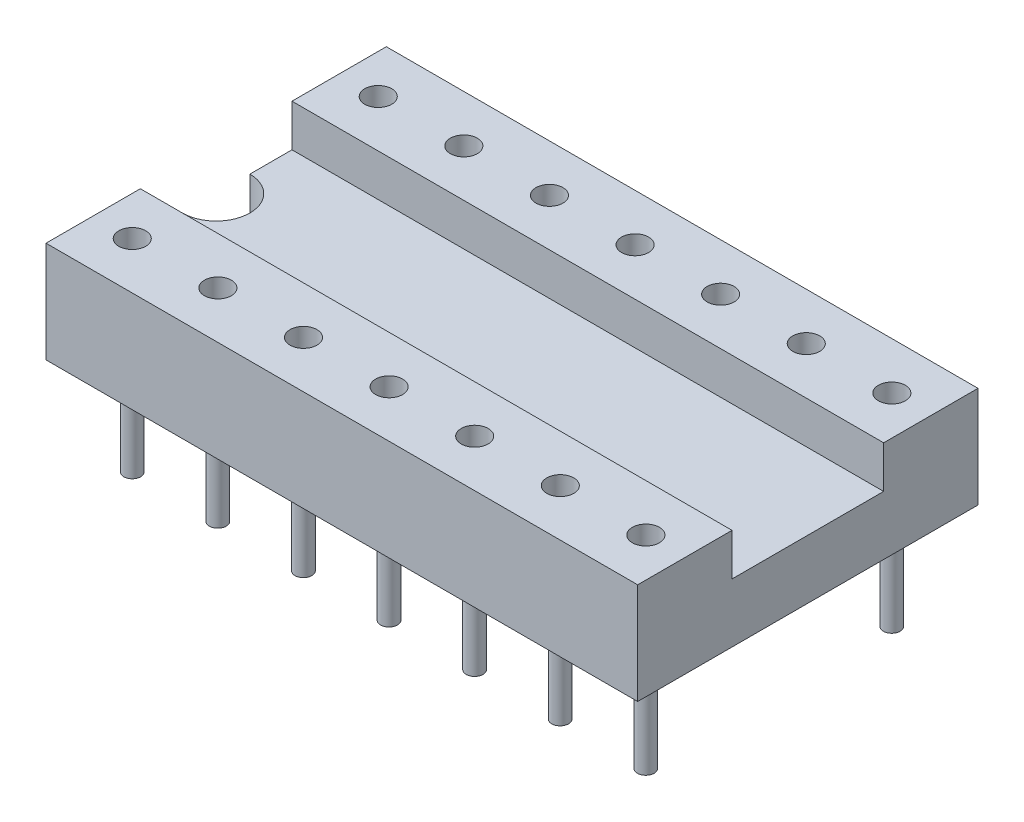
from build123d import *

# Parameters (mm, degrees)
EXTRUSION1_DEPTH        = 17.56
ENL_V_MAT_EXTRU_1_DEPTH = 19.355342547
ESQUISSE3_R             = 0.4
ENL_V_MAT_EXTRU_2_DEPTH = 2.5
ESQUISSE5_R             = 0.25
EXTRUSION2_DEPTH        = 3


with BuildPart() as part:
    # Esquisse1 → Extrusion1 (new body)
    with BuildSketch(Plane(origin=(0, 0, 0), x_dir=(0, 0, -1), z_dir=(1, 0, 0))):
        Polygon((-2.25, 1.75), (-2.25, 3), (-5.05, 3), (-5.05, 0), (5.05, 0), (5.05, 3), (2.25, 3), (2.25, 1.75), align=None)
    extrude(amount=EXTRUSION1_DEPTH)

    # Esquisse2 → Enl_v. mat.-Extru.1 (cut, through all)
    with BuildSketch(Plane(origin=(0, 1.75, 0), x_dir=(-1, 0, 0), z_dir=(0, 1, 0))):
        with BuildLine():
            Line((0, -1), (0, 1))
            ThreePointArc((0, 1), (-1, 0), (0, -1))
        make_face()
    extrude(amount=-ENL_V_MAT_EXTRU_1_DEPTH, mode=Mode.SUBTRACT)

    # Esquisse3 → Enl_v. mat.-Extru.2 (cut)
    with BuildSketch(Plane(origin=(0, 3, 0), x_dir=(-1, 0, 0), z_dir=(0, 1, 0))):
        with Locations(Location((-1.16, 3.65, 0), (0, 0, 90))):
            Circle(ESQUISSE3_R)
        with Locations(Location((-1.16, -3.65, 0), (0, 0, 270))):
            Circle(ESQUISSE3_R)
        with Locations(Location((-3.701, 3.65, 0), (0, 0, 90))):
            Circle(ESQUISSE3_R)
        with Locations(Location((-3.701, -3.65, 0), (0, 0, 270))):
            Circle(ESQUISSE3_R)
        with Locations(Location((-6.242, 3.65, 0), (0, 0, 90))):
            Circle(ESQUISSE3_R)
        with Locations(Location((-6.242, -3.65, 0), (0, 0, 270))):
            Circle(ESQUISSE3_R)
        with Locations(Location((-8.783, 3.65, 0), (0, 0, 90))):
            Circle(ESQUISSE3_R)
        with Locations(Location((-8.783, -3.65, 0), (0, 0, 270))):
            Circle(ESQUISSE3_R)
        with Locations(Location((-11.323, 3.65, 0), (0, 0, 90))):
            Circle(ESQUISSE3_R)
        with Locations(Location((-11.323, -3.65, 0), (0, 0, 270))):
            Circle(ESQUISSE3_R)
        with Locations(Location((-13.863, 3.65, 0), (0, 0, 90))):
            Circle(ESQUISSE3_R)
        with Locations(Location((-13.863, -3.65, 0), (0, 0, 270))):
            Circle(ESQUISSE3_R)
        with Locations(Location((-16.403, 3.65, 0), (0, 0, 90))):
            Circle(ESQUISSE3_R)
        with Locations(Location((-16.403, -3.65, 0), (0, 0, 270))):
            Circle(ESQUISSE3_R)
    extrude(amount=-ENL_V_MAT_EXTRU_2_DEPTH, mode=Mode.SUBTRACT)

    # Esquisse5 → Extrusion2 (add)
    with BuildSketch(Plane.XZ):
        with Locations(Location((1.16, 3.65, 0), (0, 0, 90))):
            Circle(ESQUISSE5_R)
        with Locations(Location((1.16, -3.65, 0), (0, 0, 90))):
            Circle(ESQUISSE5_R)
        with Locations(Location((3.7, -3.65, 0), (0, 0, 90))):
            Circle(ESQUISSE5_R)
        with Locations(Location((3.7, 3.65, 0), (0, 0, 90))):
            Circle(ESQUISSE5_R)
        with Locations(Location((6.24, -3.65, 0), (0, 0, 90))):
            Circle(ESQUISSE5_R)
        with Locations(Location((6.24, 3.65, 0), (0, 0, 90))):
            Circle(ESQUISSE5_R)
        with Locations(Location((8.78, -3.65, 0), (0, 0, 90))):
            Circle(ESQUISSE5_R)
        with Locations(Location((8.78, 3.65, 0), (0, 0, 90))):
            Circle(ESQUISSE5_R)
        with Locations(Location((11.32, -3.65, 0), (0, 0, 90))):
            Circle(ESQUISSE5_R)
        with Locations(Location((11.32, 3.65, 0), (0, 0, 90))):
            Circle(ESQUISSE5_R)
        with Locations(Location((13.86, -3.65, 0), (0, 0, 90))):
            Circle(ESQUISSE5_R)
        with Locations(Location((13.86, 3.65, 0), (0, 0, 90))):
            Circle(ESQUISSE5_R)
        with Locations(Location((16.4, -3.65, 0), (0, 0, 90))):
            Circle(ESQUISSE5_R)
        with Locations(Location((16.4, 3.65, 0), (0, 0, 90))):
            Circle(ESQUISSE5_R)
    extrude(amount=EXTRUSION2_DEPTH)


solid = part.part
